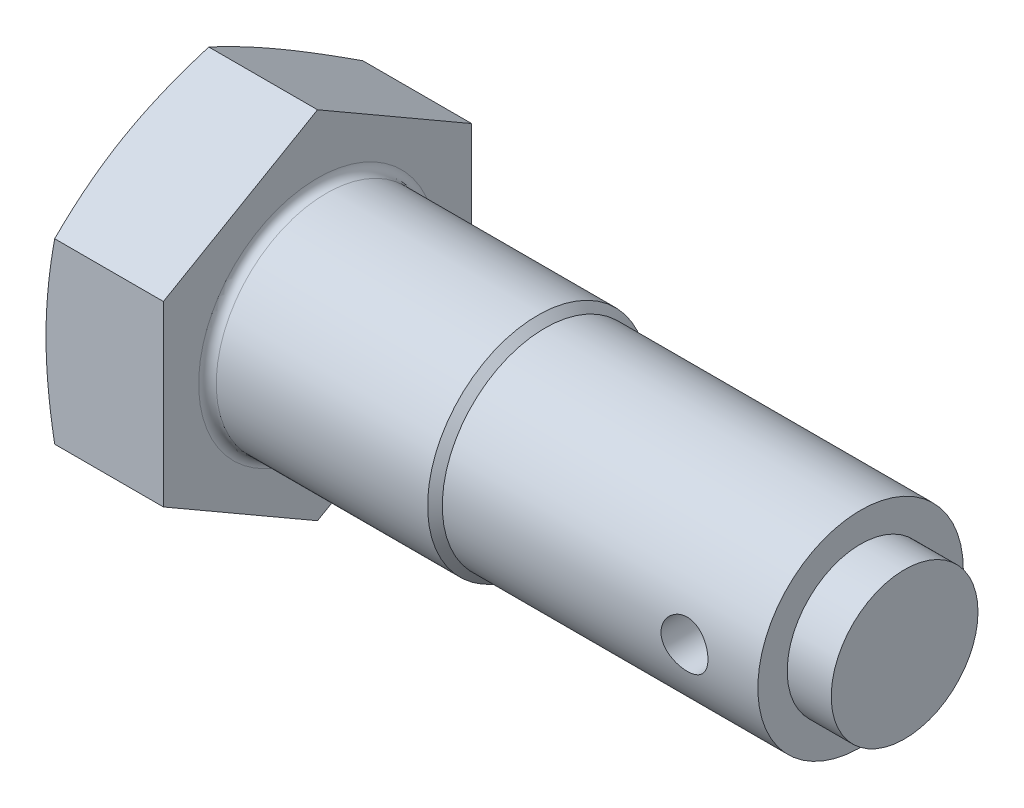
ISO-10303-21;
HEADER;
FILE_DESCRIPTION(('STEP AP214'),'2;1');
FILE_NAME('part.step','',(''),(''),'','','');
FILE_SCHEMA(('AUTOMOTIVE_DESIGN { 1 0 10303 214 1 1 1 1 }'));
ENDSEC;
DATA;
#1=APPLICATION_CONTEXT('core data for automotive mechanical design processes');
#2=APPLICATION_PROTOCOL_DEFINITION('international standard','automotive_design',2000,#1);
#3=PRODUCT_CONTEXT('',#1,'mechanical');
#4=PRODUCT('Part','Part','',(#3));
#5=PRODUCT_RELATED_PRODUCT_CATEGORY('part','',(#4));
#6=PRODUCT_DEFINITION_FORMATION('','',#4);
#7=PRODUCT_DEFINITION_CONTEXT('part definition',#1,'design');
#8=PRODUCT_DEFINITION('design','',#6,#7);
#9=PRODUCT_DEFINITION_SHAPE('','',#8);
#10=(LENGTH_UNIT() NAMED_UNIT(*) SI_UNIT(.MILLI.,.METRE.));
#11=(NAMED_UNIT(*) PLANE_ANGLE_UNIT() SI_UNIT($,.RADIAN.));
#12=(NAMED_UNIT(*) SI_UNIT($,.STERADIAN.) SOLID_ANGLE_UNIT());
#13=UNCERTAINTY_MEASURE_WITH_UNIT(LENGTH_MEASURE(1.E-05),#10,'distance_accuracy_value','');
#14=(GEOMETRIC_REPRESENTATION_CONTEXT(3) GLOBAL_UNCERTAINTY_ASSIGNED_CONTEXT((#13)) GLOBAL_UNIT_ASSIGNED_CONTEXT((#10,
#11,#12)) REPRESENTATION_CONTEXT('',''));
#15=CARTESIAN_POINT('',(0.,0.,0.));
#16=DIRECTION('',(0.,0.,1.));
#17=DIRECTION('',(1.,0.,0.));
#18=AXIS2_PLACEMENT_3D('',#15,#16,#17);
#19=CARTESIAN_POINT('',(8.,-6.06217782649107,10.5));
#20=DIRECTION('',(0.,0.866025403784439,-0.5));
#21=DIRECTION('',(0.,0.5,0.866025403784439));
#22=AXIS2_PLACEMENT_3D('',#19,#20,#21);
#23=PLANE('',#22);
#24=CARTESIAN_POINT('',(0.591259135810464,-12.124471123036,-0.000200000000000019));
#25=CARTESIAN_POINT('',(0.499848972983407,-11.8734134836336,0.434644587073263));
#26=CARTESIAN_POINT('',(0.416695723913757,-11.6215279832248,0.87092307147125));
#27=CARTESIAN_POINT('',(0.270400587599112,-11.1161192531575,1.74631667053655));
#28=CARTESIAN_POINT('',(0.207274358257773,-10.8625948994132,2.18543373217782));
#29=CARTESIAN_POINT('',(0.105169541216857,-10.3567219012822,3.06163146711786));
#30=CARTESIAN_POINT('',(0.0659682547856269,-10.1043848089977,3.49869213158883));
#31=CARTESIAN_POINT('',(0.0133883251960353,-9.59912055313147,4.37383549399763));
#32=CARTESIAN_POINT('',(0.,-9.34619364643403,4.81191774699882));
#33=CARTESIAN_POINT('',(0.,-8.84033983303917,5.68808225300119));
#34=CARTESIAN_POINT('',(0.0133883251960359,-8.58741292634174,6.12616450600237));
#35=CARTESIAN_POINT('',(0.0659682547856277,-8.0821486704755,7.00130786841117));
#36=CARTESIAN_POINT('',(0.105169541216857,-7.82981157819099,7.43836853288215));
#37=CARTESIAN_POINT('',(0.207274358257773,-7.32393858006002,8.31456626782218));
#38=CARTESIAN_POINT('',(0.270400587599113,-7.07041422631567,8.75368332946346));
#39=CARTESIAN_POINT('',(0.416695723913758,-6.56500549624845,9.62907692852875));
#40=CARTESIAN_POINT('',(0.499848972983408,-6.31311999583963,10.0653554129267));
#41=CARTESIAN_POINT('',(0.591259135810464,-6.06206235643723,10.5002));
#42=B_SPLINE_CURVE_WITH_KNOTS('',3,(#24,#25,#26,#27,#28,#29,#30,#31,#32,#33,#34,#35,#36,#37,#38,
#39,#40,#41),.UNSPECIFIED.,.F.,.F.,(4,2,2,2,2,2,2,2,4),(0.,1.5312621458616,3.06371855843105,
4.58168385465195,6.09907967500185,7.61647549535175,9.13444079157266,10.6668972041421,
12.1981593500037),.UNSPECIFIED.);
#43=CARTESIAN_POINT('',(0.591217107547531,-12.1243556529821,0.));
#44=VERTEX_POINT('',#43);
#45=CARTESIAN_POINT('',(0.,-9.09326673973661,5.25));
#46=VERTEX_POINT('',#45);
#47=EDGE_CURVE('E279',#44,#46,#42,.T.);
#48=ORIENTED_EDGE('',*,*,#47,.F.);
#49=DIRECTION('',(-1.,0.,0.));
#50=VECTOR('',#49,1.);
#51=CARTESIAN_POINT('',(8.,-12.1243556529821,0.));
#52=LINE('',#51,#50);
#53=CARTESIAN_POINT('',(8.,-12.1243556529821,0.));
#54=VERTEX_POINT('',#53);
#55=EDGE_CURVE('E149',#54,#44,#52,.T.);
#56=ORIENTED_EDGE('',*,*,#55,.F.);
#57=DIRECTION('',(0.,-0.5,-0.866025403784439));
#58=VECTOR('',#57,1.);
#59=CARTESIAN_POINT('',(8.,-6.06217782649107,10.5));
#60=LINE('',#59,#58);
#61=CARTESIAN_POINT('',(8.,-6.06217782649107,10.5));
#62=VERTEX_POINT('',#61);
#63=EDGE_CURVE('E291',#62,#54,#60,.T.);
#64=ORIENTED_EDGE('',*,*,#63,.F.);
#65=DIRECTION('',(-1.,0.,0.));
#66=VECTOR('',#65,1.);
#67=CARTESIAN_POINT('',(8.,-6.06217782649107,10.5));
#68=LINE('',#67,#66);
#69=CARTESIAN_POINT('',(0.591217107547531,-6.06217782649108,10.5));
#70=VERTEX_POINT('',#69);
#71=EDGE_CURVE('E136',#62,#70,#68,.T.);
#72=ORIENTED_EDGE('',*,*,#71,.T.);
#73=EDGE_CURVE('E130',#46,#70,#42,.T.);
#74=ORIENTED_EDGE('',*,*,#73,.F.);
#75=EDGE_LOOP('',(#48,#56,#64,#72,#74));
#76=FACE_BOUND('',#75,.T.);
#77=ADVANCED_FACE('F35',(#76),#23,.F.);
#78=CARTESIAN_POINT('',(8.,-12.1243556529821,0.));
#79=DIRECTION('',(0.,0.866025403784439,0.5));
#80=DIRECTION('',(0.,-0.5,0.866025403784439));
#81=AXIS2_PLACEMENT_3D('',#78,#79,#80);
#82=PLANE('',#81);
#83=CARTESIAN_POINT('',(0.591259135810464,-6.06206235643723,-10.5002));
#84=CARTESIAN_POINT('',(0.499848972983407,-6.31311999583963,-10.0653554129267));
#85=CARTESIAN_POINT('',(0.416695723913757,-6.56500549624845,-9.62907692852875));
#86=CARTESIAN_POINT('',(0.270400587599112,-7.07041422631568,-8.75368332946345));
#87=CARTESIAN_POINT('',(0.207274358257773,-7.32393858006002,-8.31456626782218));
#88=CARTESIAN_POINT('',(0.105169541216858,-7.82981157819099,-7.43836853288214));
#89=CARTESIAN_POINT('',(0.0659682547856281,-8.08214867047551,-7.00130786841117));
#90=CARTESIAN_POINT('',(0.0133883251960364,-8.58741292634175,-6.12616450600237));
#91=CARTESIAN_POINT('',(0.,-8.84033983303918,-5.68808225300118));
#92=CARTESIAN_POINT('',(0.,-9.34619364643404,-4.81191774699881));
#93=CARTESIAN_POINT('',(0.0133883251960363,-9.59912055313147,-4.37383549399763));
#94=CARTESIAN_POINT('',(0.0659682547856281,-10.1043848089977,-3.49869213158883));
#95=CARTESIAN_POINT('',(0.105169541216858,-10.3567219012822,-3.06163146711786));
#96=CARTESIAN_POINT('',(0.207274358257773,-10.8625948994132,-2.18543373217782));
#97=CARTESIAN_POINT('',(0.270400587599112,-11.1161192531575,-1.74631667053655));
#98=CARTESIAN_POINT('',(0.416695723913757,-11.6215279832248,-0.870923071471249));
#99=CARTESIAN_POINT('',(0.499848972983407,-11.8734134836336,-0.434644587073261));
#100=CARTESIAN_POINT('',(0.591259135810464,-12.124471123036,0.000200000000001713));
#101=B_SPLINE_CURVE_WITH_KNOTS('',3,(#83,#84,#85,#86,#87,#88,#89,#90,#91,#92,#93,#94,#95,#96,
#97,#98,#99,#100),.UNSPECIFIED.,.F.,.F.,(4,2,2,2,2,2,2,2,4),(0.,1.5312621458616,
3.06371855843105,4.58168385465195,6.09907967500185,7.61647549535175,9.13444079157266,
10.6668972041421,12.1981593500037),.UNSPECIFIED.);
#102=CARTESIAN_POINT('',(0.591217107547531,-6.06217782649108,-10.5));
#103=VERTEX_POINT('',#102);
#104=CARTESIAN_POINT('',(0.,-9.09326673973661,-5.25));
#105=VERTEX_POINT('',#104);
#106=EDGE_CURVE('E226',#103,#105,#101,.T.);
#107=ORIENTED_EDGE('',*,*,#106,.F.);
#108=DIRECTION('',(-1.,0.,0.));
#109=VECTOR('',#108,1.);
#110=CARTESIAN_POINT('',(8.,-6.06217782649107,-10.5));
#111=LINE('',#110,#109);
#112=CARTESIAN_POINT('',(8.,-6.06217782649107,-10.5));
#113=VERTEX_POINT('',#112);
#114=EDGE_CURVE('E146',#113,#103,#111,.T.);
#115=ORIENTED_EDGE('',*,*,#114,.F.);
#116=DIRECTION('',(0.,0.5,-0.866025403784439));
#117=VECTOR('',#116,1.);
#118=CARTESIAN_POINT('',(8.,-12.1243556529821,0.));
#119=LINE('',#118,#117);
#120=EDGE_CURVE('E286',#54,#113,#119,.T.);
#121=ORIENTED_EDGE('',*,*,#120,.F.);
#122=ORIENTED_EDGE('',*,*,#55,.T.);
#123=EDGE_CURVE('E222',#105,#44,#101,.T.);
#124=ORIENTED_EDGE('',*,*,#123,.F.);
#125=EDGE_LOOP('',(#107,#115,#121,#122,#124));
#126=FACE_BOUND('',#125,.T.);
#127=ADVANCED_FACE('F233',(#126),#82,.F.);
#128=CARTESIAN_POINT('',(8.,-6.06217782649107,-10.5));
#129=DIRECTION('',(0.,0.,1.));
#130=DIRECTION('',(1.,0.,0.));
#131=AXIS2_PLACEMENT_3D('',#128,#129,#130);
#132=PLANE('',#131);
#133=CARTESIAN_POINT('',(3.15922975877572,-16.0505152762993,-10.5));
#134=CARTESIAN_POINT('',(3.0145747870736,-15.5754573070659,-10.5));
#135=CARTESIAN_POINT('',(2.87160775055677,-15.0998758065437,-10.5));
#136=CARTESIAN_POINT('',(2.58998331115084,-14.1473992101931,-10.5));
#137=CARTESIAN_POINT('',(2.45132624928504,-13.6705040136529,-10.5));
#138=CARTESIAN_POINT('',(2.17902486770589,-12.7143172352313,-10.5));
#139=CARTESIAN_POINT('',(2.0453903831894,-12.2350228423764,-10.5));
#140=CARTESIAN_POINT('',(1.78469865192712,-11.2746511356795,-10.5));
#141=CARTESIAN_POINT('',(1.65764128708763,-10.7935738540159,-10.5));
#142=CARTESIAN_POINT('',(1.41324865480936,-9.83526050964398,-10.5));
#143=CARTESIAN_POINT('',(1.29581283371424,-9.35805021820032,-10.5));
#144=CARTESIAN_POINT('',(1.07093944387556,-8.40125497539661,-10.5));
#145=CARTESIAN_POINT('',(0.963502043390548,-7.92166998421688,-10.5));
#146=CARTESIAN_POINT('',(0.76113029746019,-6.96001802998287,-10.5));
#147=CARTESIAN_POINT('',(0.66619168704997,-6.47795197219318,-10.5));
#148=CARTESIAN_POINT('',(0.491708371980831,-5.51102112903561,-10.5));
#149=CARTESIAN_POINT('',(0.412163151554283,-5.0261564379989,-10.5));
#150=CARTESIAN_POINT('',(0.279574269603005,-4.10822599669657,-10.5));
#151=CARTESIAN_POINT('',(0.224559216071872,-3.67544767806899,-10.5));
#152=CARTESIAN_POINT('',(0.131431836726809,-2.80806103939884,-10.5));
#153=CARTESIAN_POINT('',(0.0933190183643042,-2.37345277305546,-10.5));
#154=CARTESIAN_POINT('',(0.0358315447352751,-1.50328778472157,-10.5));
#155=CARTESIAN_POINT('',(0.016443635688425,-1.06773195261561,-10.5));
#156=CARTESIAN_POINT('',(-0.00261241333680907,-0.196184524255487,-10.5));
#157=CARTESIAN_POINT('',(-0.00228069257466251,0.239807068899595,-10.5));
#158=CARTESIAN_POINT('',(0.0181361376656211,1.11353215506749,-10.5));
#159=CARTESIAN_POINT('',(0.0383214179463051,1.55126326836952,-10.5));
#160=CARTESIAN_POINT('',(0.0975164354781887,2.42543976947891,-10.5));
#161=CARTESIAN_POINT('',(0.136526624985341,2.86188512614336,-10.5));
#162=CARTESIAN_POINT('',(0.231546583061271,3.73327460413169,-10.5));
#163=CARTESIAN_POINT('',(0.287570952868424,4.16821711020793,-10.5));
#164=CARTESIAN_POINT('',(0.414346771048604,5.03592621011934,-10.5));
#165=CARTESIAN_POINT('',(0.485098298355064,5.46869279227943,-10.5));
#166=CARTESIAN_POINT('',(0.643097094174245,6.35482313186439,-10.5));
#167=CARTESIAN_POINT('',(0.731018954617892,6.80806553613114,-10.5));
#168=CARTESIAN_POINT('',(0.91817874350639,7.71222283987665,-10.5));
#169=CARTESIAN_POINT('',(1.01741752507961,8.16313756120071,-10.5));
#170=CARTESIAN_POINT('',(1.2251273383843,9.06296081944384,-10.5));
#171=CARTESIAN_POINT('',(1.3336010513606,9.51186873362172,-10.5));
#172=CARTESIAN_POINT('',(1.55801620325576,10.4077935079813,-10.5));
#173=CARTESIAN_POINT('',(1.67395746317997,10.8548104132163,-10.5));
#174=CARTESIAN_POINT('',(1.91206455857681,11.7477923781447,-10.5));
#175=CARTESIAN_POINT('',(2.03423819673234,12.1937553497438,-10.5));
#176=CARTESIAN_POINT('',(2.28355565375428,13.0842879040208,-10.5));
#177=CARTESIAN_POINT('',(2.41069949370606,13.5288574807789,-10.5));
#178=CARTESIAN_POINT('',(2.66904579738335,14.4167303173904,-10.5));
#179=CARTESIAN_POINT('',(2.80024755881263,14.8600337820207,-10.5));
#180=CARTESIAN_POINT('',(3.06603135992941,15.7456273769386,-10.5));
#181=CARTESIAN_POINT('',(3.20061342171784,16.1879175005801,-10.5));
#182=CARTESIAN_POINT('',(3.60555235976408,17.503732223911,-10.5));
#183=CARTESIAN_POINT('',(3.87998373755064,18.3760026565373,-10.5));
#184=CARTESIAN_POINT('',(4.43662333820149,20.1180920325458,-10.5));
#185=CARTESIAN_POINT('',(4.71883193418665,20.9879108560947,-10.5));
#186=CARTESIAN_POINT('',(5.28787047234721,22.7223782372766,-10.5));
#187=CARTESIAN_POINT('',(5.57467881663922,23.5870338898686,-10.5));
#188=CARTESIAN_POINT('',(6.00807288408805,24.882911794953,-10.5));
#189=CARTESIAN_POINT('',(6.15306192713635,25.314669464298,-10.5));
#190=CARTESIAN_POINT('',(6.44397819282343,26.1778674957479,-10.5));
#191=CARTESIAN_POINT('',(6.58990541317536,26.6093078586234,-10.5));
#192=CARTESIAN_POINT('',(6.73623905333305,27.0406104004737,-10.5));
#193=B_SPLINE_CURVE_WITH_KNOTS('',3,(#133,#134,#135,#136,#137,#138,#139,#140,#141,#142,#143,
#144,#145,#146,#147,#148,#149,#150,#151,#152,#153,#154,#155,#156,#157,#158,#159,#160,#161,#162,
#163,#164,#165,#166,#167,#168,#169,#170,#171,#172,#173,#174,#175,#176,#177,#178,#179,#180,#181,
#182,#183,#184,#185,#186,#187,#188,#189,#190,#191,#192),.UNSPECIFIED.,.F.,.F.,(4,2,2,2,2,2,2,2,
2,2,2,2,2,2,2,2,2,2,2,2,2,2,2,2,2,2,2,2,2,4),(0.,1.48979114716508,2.97969987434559,
4.47238840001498,5.96505011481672,7.43930808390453,8.91359085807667,10.3873692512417,
11.8610982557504,13.1695941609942,14.478051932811,15.7855828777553,17.093104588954,
18.4072573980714,19.72144178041,21.0367571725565,22.3520796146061,23.7369766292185,
25.1219781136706,26.5073830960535,27.8927548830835,29.2799058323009,30.6670626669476,
32.0539807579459,33.4409079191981,36.1841157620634,38.9274554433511,41.6603859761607,
43.0267411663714,44.3930930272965),.UNSPECIFIED.);
#194=CARTESIAN_POINT('',(0.591217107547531,6.06217782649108,-10.5));
#195=VERTEX_POINT('',#194);
#196=CARTESIAN_POINT('',(0.,0.,-10.5));
#197=VERTEX_POINT('',#196);
#198=EDGE_CURVE('E307',#195,#197,#193,.F.);
#199=ORIENTED_EDGE('',*,*,#198,.F.);
#200=DIRECTION('',(-1.,0.,0.));
#201=VECTOR('',#200,1.);
#202=CARTESIAN_POINT('',(8.,6.06217782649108,-10.5));
#203=LINE('',#202,#201);
#204=CARTESIAN_POINT('',(8.,6.06217782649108,-10.5));
#205=VERTEX_POINT('',#204);
#206=EDGE_CURVE('E138',#205,#195,#203,.T.);
#207=ORIENTED_EDGE('',*,*,#206,.F.);
#208=DIRECTION('',(0.,1.,0.));
#209=VECTOR('',#208,1.);
#210=CARTESIAN_POINT('',(8.,-6.06217782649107,-10.5));
#211=LINE('',#210,#209);
#212=EDGE_CURVE('E290',#113,#205,#211,.T.);
#213=ORIENTED_EDGE('',*,*,#212,.F.);
#214=ORIENTED_EDGE('',*,*,#114,.T.);
#215=EDGE_CURVE('E227',#197,#103,#193,.F.);
#216=ORIENTED_EDGE('',*,*,#215,.F.);
#217=EDGE_LOOP('',(#199,#207,#213,#214,#216));
#218=FACE_BOUND('',#217,.T.);
#219=ADVANCED_FACE('F236',(#218),#132,.F.);
#220=CARTESIAN_POINT('',(8.,6.06217782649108,-10.5));
#221=DIRECTION('',(0.,-0.866025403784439,0.5));
#222=DIRECTION('',(0.,-0.5,-0.866025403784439));
#223=AXIS2_PLACEMENT_3D('',#220,#221,#222);
#224=PLANE('',#223);
#225=CARTESIAN_POINT('',(0.591259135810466,12.124471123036,0.000199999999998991));
#226=CARTESIAN_POINT('',(0.49984897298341,11.8734134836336,-0.434644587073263));
#227=CARTESIAN_POINT('',(0.41669572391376,11.6215279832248,-0.870923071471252));
#228=CARTESIAN_POINT('',(0.270400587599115,11.1161192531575,-1.74631667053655));
#229=CARTESIAN_POINT('',(0.207274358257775,10.8625948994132,-2.18543373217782));
#230=CARTESIAN_POINT('',(0.10516954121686,10.3567219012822,-3.06163146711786));
#231=CARTESIAN_POINT('',(0.0659682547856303,10.1043848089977,-3.49869213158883));
#232=CARTESIAN_POINT('',(0.0133883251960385,9.59912055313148,-4.37383549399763));
#233=CARTESIAN_POINT('',(0.,9.34619364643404,-4.81191774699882));
#234=CARTESIAN_POINT('',(0.,8.84033983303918,-5.68808225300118));
#235=CARTESIAN_POINT('',(0.0133883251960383,8.58741292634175,-6.12616450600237));
#236=CARTESIAN_POINT('',(0.06596825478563,8.08214867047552,-7.00130786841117));
#237=CARTESIAN_POINT('',(0.10516954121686,7.829811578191,-7.43836853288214));
#238=CARTESIAN_POINT('',(0.207274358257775,7.32393858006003,-8.31456626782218));
#239=CARTESIAN_POINT('',(0.270400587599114,7.07041422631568,-8.75368332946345));
#240=CARTESIAN_POINT('',(0.416695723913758,6.56500549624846,-9.62907692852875));
#241=CARTESIAN_POINT('',(0.499848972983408,6.31311999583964,-10.0653554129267));
#242=CARTESIAN_POINT('',(0.591259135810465,6.06206235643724,-10.5002));
#243=B_SPLINE_CURVE_WITH_KNOTS('',3,(#225,#226,#227,#228,#229,#230,#231,#232,#233,#234,#235,
#236,#237,#238,#239,#240,#241,#242),.UNSPECIFIED.,.F.,.F.,(4,2,2,2,2,2,2,2,4),(0.,
1.5312621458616,3.06371855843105,4.58168385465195,6.09907967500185,7.61647549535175,
9.13444079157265,10.6668972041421,12.1981593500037),.UNSPECIFIED.);
#244=CARTESIAN_POINT('',(0.591217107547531,12.1243556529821,0.));
#245=VERTEX_POINT('',#244);
#246=CARTESIAN_POINT('',(0.,9.09326673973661,-5.25));
#247=VERTEX_POINT('',#246);
#248=EDGE_CURVE('E56',#245,#247,#243,.T.);
#249=ORIENTED_EDGE('',*,*,#248,.F.);
#250=DIRECTION('',(-1.,0.,0.));
#251=VECTOR('',#250,1.);
#252=CARTESIAN_POINT('',(8.,12.1243556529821,0.));
#253=LINE('',#252,#251);
#254=CARTESIAN_POINT('',(8.,12.1243556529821,0.));
#255=VERTEX_POINT('',#254);
#256=EDGE_CURVE('E135',#255,#245,#253,.T.);
#257=ORIENTED_EDGE('',*,*,#256,.F.);
#258=DIRECTION('',(0.,0.5,0.866025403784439));
#259=VECTOR('',#258,1.);
#260=CARTESIAN_POINT('',(8.,6.06217782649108,-10.5));
#261=LINE('',#260,#259);
#262=EDGE_CURVE('E299',#205,#255,#261,.T.);
#263=ORIENTED_EDGE('',*,*,#262,.F.);
#264=ORIENTED_EDGE('',*,*,#206,.T.);
#265=EDGE_CURVE('E305',#247,#195,#243,.T.);
#266=ORIENTED_EDGE('',*,*,#265,.F.);
#267=EDGE_LOOP('',(#249,#257,#263,#264,#266));
#268=FACE_BOUND('',#267,.T.);
#269=ADVANCED_FACE('F240',(#268),#224,.F.);
#270=CARTESIAN_POINT('',(8.,12.1243556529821,0.));
#271=DIRECTION('',(0.,-0.866025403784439,-0.5));
#272=DIRECTION('',(0.,0.5,-0.866025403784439));
#273=AXIS2_PLACEMENT_3D('',#270,#271,#272);
#274=PLANE('',#273);
#275=CARTESIAN_POINT('',(0.591259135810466,6.06206235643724,10.5002));
#276=CARTESIAN_POINT('',(0.49984897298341,6.31311999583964,10.0653554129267));
#277=CARTESIAN_POINT('',(0.41669572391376,6.56500549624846,9.62907692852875));
#278=CARTESIAN_POINT('',(0.270400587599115,7.07041422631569,8.75368332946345));
#279=CARTESIAN_POINT('',(0.207274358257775,7.32393858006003,8.31456626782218));
#280=CARTESIAN_POINT('',(0.10516954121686,7.829811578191,7.43836853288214));
#281=CARTESIAN_POINT('',(0.0659682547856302,8.08214867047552,7.00130786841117));
#282=CARTESIAN_POINT('',(0.013388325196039,8.58741292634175,6.12616450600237));
#283=CARTESIAN_POINT('',(0.,8.84033983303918,5.68808225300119));
#284=CARTESIAN_POINT('',(0.,9.34619364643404,4.81191774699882));
#285=CARTESIAN_POINT('',(0.013388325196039,9.59912055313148,4.37383549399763));
#286=CARTESIAN_POINT('',(0.0659682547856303,10.1043848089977,3.49869213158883));
#287=CARTESIAN_POINT('',(0.10516954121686,10.3567219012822,3.06163146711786));
#288=CARTESIAN_POINT('',(0.207274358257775,10.8625948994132,2.18543373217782));
#289=CARTESIAN_POINT('',(0.270400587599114,11.1161192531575,1.74631667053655));
#290=CARTESIAN_POINT('',(0.416695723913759,11.6215279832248,0.870923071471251));
#291=CARTESIAN_POINT('',(0.499848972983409,11.8734134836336,0.434644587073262));
#292=CARTESIAN_POINT('',(0.591259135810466,12.124471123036,-0.000199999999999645));
#293=B_SPLINE_CURVE_WITH_KNOTS('',3,(#275,#276,#277,#278,#279,#280,#281,#282,#283,#284,#285,
#286,#287,#288,#289,#290,#291,#292),.UNSPECIFIED.,.F.,.F.,(4,2,2,2,2,2,2,2,4),(0.,
1.5312621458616,3.06371855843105,4.58168385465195,6.09907967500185,7.61647549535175,
9.13444079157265,10.6668972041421,12.1981593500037),.UNSPECIFIED.);
#294=CARTESIAN_POINT('',(0.591217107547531,6.06217782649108,10.5));
#295=VERTEX_POINT('',#294);
#296=CARTESIAN_POINT('',(0.,9.09326673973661,5.25));
#297=VERTEX_POINT('',#296);
#298=EDGE_CURVE('E64',#295,#297,#293,.T.);
#299=ORIENTED_EDGE('',*,*,#298,.F.);
#300=DIRECTION('',(-1.,0.,0.));
#301=VECTOR('',#300,1.);
#302=CARTESIAN_POINT('',(8.,6.06217782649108,10.5));
#303=LINE('',#302,#301);
#304=CARTESIAN_POINT('',(8.,6.06217782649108,10.5));
#305=VERTEX_POINT('',#304);
#306=EDGE_CURVE('E126',#305,#295,#303,.T.);
#307=ORIENTED_EDGE('',*,*,#306,.F.);
#308=DIRECTION('',(0.,-0.5,0.866025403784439));
#309=VECTOR('',#308,1.);
#310=CARTESIAN_POINT('',(8.,12.1243556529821,0.));
#311=LINE('',#310,#309);
#312=EDGE_CURVE('E301',#255,#305,#311,.T.);
#313=ORIENTED_EDGE('',*,*,#312,.F.);
#314=ORIENTED_EDGE('',*,*,#256,.T.);
#315=EDGE_CURVE('E129',#297,#245,#293,.T.);
#316=ORIENTED_EDGE('',*,*,#315,.F.);
#317=EDGE_LOOP('',(#299,#307,#313,#314,#316));
#318=FACE_BOUND('',#317,.T.);
#319=ADVANCED_FACE('F124',(#318),#274,.F.);
#320=CARTESIAN_POINT('',(8.,6.06217782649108,10.5));
#321=DIRECTION('',(0.,0.,-1.));
#322=DIRECTION('',(0.,1.,0.));
#323=AXIS2_PLACEMENT_3D('',#320,#321,#322);
#324=PLANE('',#323);
#325=CARTESIAN_POINT('',(3.15923032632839,-16.0505171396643,10.5));
#326=CARTESIAN_POINT('',(3.01457532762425,-15.5754590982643,10.5));
#327=CARTESIAN_POINT('',(2.87160826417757,-15.0998775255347,10.5));
#328=CARTESIAN_POINT('',(2.58998377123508,-14.1474007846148,10.5));
#329=CARTESIAN_POINT('',(2.45132668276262,-13.6705055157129,10.5));
#330=CARTESIAN_POINT('',(2.17902524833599,-12.7143185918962,10.5));
#331=CARTESIAN_POINT('',(2.04539073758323,-12.2350241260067,10.5));
#332=CARTESIAN_POINT('',(1.78469895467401,-11.2746522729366,10.5));
#333=CARTESIAN_POINT('',(1.65764156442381,-10.7935749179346,10.5));
#334=CARTESIAN_POINT('',(1.41324888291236,-9.83526142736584,10.5));
#335=CARTESIAN_POINT('',(1.29581303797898,-9.35805106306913,10.5));
#336=CARTESIAN_POINT('',(1.07093960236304,-8.40125567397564,10.5));
#337=CARTESIAN_POINT('',(0.96350217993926,-7.92167060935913,10.5));
#338=CARTESIAN_POINT('',(0.761130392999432,-6.96001850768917,10.5));
#339=CARTESIAN_POINT('',(0.666191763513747,-6.47795237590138,10.5));
#340=CARTESIAN_POINT('',(0.491708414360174,-5.51102138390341,10.5));
#341=CARTESIAN_POINT('',(0.412163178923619,-5.02615661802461,10.5));
#342=CARTESIAN_POINT('',(0.279574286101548,-4.10822611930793,10.5));
#343=CARTESIAN_POINT('',(0.224559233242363,-3.67544781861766,10.5));
#344=CARTESIAN_POINT('',(0.131431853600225,-2.80806121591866,10.5));
#345=CARTESIAN_POINT('',(0.0933190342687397,-2.37345296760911,10.5));
#346=CARTESIAN_POINT('',(0.0358315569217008,-1.50328801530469,10.5));
#347=CARTESIAN_POINT('',(0.0164436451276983,-1.06773220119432,10.5));
#348=CARTESIAN_POINT('',(-0.00261241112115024,-0.19618480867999,10.5));
#349=CARTESIAN_POINT('',(-0.00228069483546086,0.239806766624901,10.5));
#350=CARTESIAN_POINT('',(0.0181361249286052,1.11353181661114,10.5));
#351=CARTESIAN_POINT('',(0.0383213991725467,1.5512629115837,10.5));
#352=CARTESIAN_POINT('',(0.0975164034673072,2.42543937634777,10.5));
#353=CARTESIAN_POINT('',(0.136526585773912,2.86188471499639,10.5));
#354=CARTESIAN_POINT('',(0.231546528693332,3.73327415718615,10.5));
#355=CARTESIAN_POINT('',(0.287570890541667,4.16821664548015,10.5));
#356=CARTESIAN_POINT('',(0.414346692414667,5.03592571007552,10.5));
#357=CARTESIAN_POINT('',(0.485098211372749,5.46869227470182,10.5));
#358=CARTESIAN_POINT('',(0.643096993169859,6.35482259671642,10.5));
#359=CARTESIAN_POINT('',(0.731018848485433,6.80806500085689,10.5));
#360=CARTESIAN_POINT('',(0.91817862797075,7.71222230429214,10.5));
#361=CARTESIAN_POINT('',(1.01741740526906,8.16313702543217,10.5));
#362=CARTESIAN_POINT('',(1.22512721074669,9.0629602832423,10.5));
#363=CARTESIAN_POINT('',(1.33360092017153,9.51186819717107,10.5));
#364=CARTESIAN_POINT('',(1.55801606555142,10.4077929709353,10.5));
#365=CARTESIAN_POINT('',(1.67395732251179,10.8548098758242,10.5));
#366=CARTESIAN_POINT('',(1.91206441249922,11.7477918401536,10.5));
#367=CARTESIAN_POINT('',(2.03423804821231,12.1937548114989,10.5));
#368=CARTESIAN_POINT('',(2.28355550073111,13.0842873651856,10.5));
#369=CARTESIAN_POINT('',(2.4106993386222,13.528856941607,10.5));
#370=CARTESIAN_POINT('',(2.66904563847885,14.4167297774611,10.5));
#371=CARTESIAN_POINT('',(2.80024739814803,14.8600332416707,10.5));
#372=CARTESIAN_POINT('',(3.06603119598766,15.745626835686,10.5));
#373=CARTESIAN_POINT('',(3.20061325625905,16.1879169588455,10.5));
#374=CARTESIAN_POINT('',(3.60555219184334,17.503731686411,10.5));
#375=CARTESIAN_POINT('',(3.8799835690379,18.3760021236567,10.5));
#376=CARTESIAN_POINT('',(4.43662316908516,20.1180915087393,10.5));
#377=CARTESIAN_POINT('',(4.71883176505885,20.9879103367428,10.5));
#378=CARTESIAN_POINT('',(5.28787030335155,22.7223777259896,10.5));
#379=CARTESIAN_POINT('',(5.57467864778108,23.5870333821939,10.5));
#380=CARTESIAN_POINT('',(6.00807271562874,24.8829112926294,10.5));
#381=CARTESIAN_POINT('',(6.15306175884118,25.3146689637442,10.5));
#382=CARTESIAN_POINT('',(6.44397802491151,26.1778669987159,10.5));
#383=CARTESIAN_POINT('',(6.58990524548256,26.6093073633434,10.5));
#384=CARTESIAN_POINT('',(6.73623888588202,27.0406099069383,10.5));
#385=B_SPLINE_CURVE_WITH_KNOTS('',3,(#325,#326,#327,#328,#329,#330,#331,#332,#333,#334,#335,
#336,#337,#338,#339,#340,#341,#342,#343,#344,#345,#346,#347,#348,#349,#350,#351,#352,#353,#354,
#355,#356,#357,#358,#359,#360,#361,#362,#363,#364,#365,#366,#367,#368,#369,#370,#371,#372,#373,
#374,#375,#376,#377,#378,#379,#380,#381,#382,#383,#384),.UNSPECIFIED.,.F.,.F.,(4,2,2,2,2,2,2,2,
2,2,2,2,2,2,2,2,2,2,2,2,2,2,2,2,2,2,2,2,2,4),(0.,1.48979137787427,2.97970033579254,
4.47238909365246,5.96505104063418,7.43930923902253,8.9135922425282,10.3873708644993,
11.8611000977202,13.1695959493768,14.4780536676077,15.7855845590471,17.0931062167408,
18.4072589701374,19.721443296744,21.0367586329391,22.3520810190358,23.7369780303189,
25.121979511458,26.5073844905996,27.892756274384,29.2799072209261,30.6670640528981,
32.0539821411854,33.4409092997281,36.1841171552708,38.9274568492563,41.6603873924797,
43.0267425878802,44.3930944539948),.UNSPECIFIED.);
#386=CARTESIAN_POINT('',(0.,0.,10.5));
#387=VERTEX_POINT('',#386);
#388=EDGE_CURVE('E119',#70,#387,#385,.T.);
#389=ORIENTED_EDGE('',*,*,#388,.F.);
#390=ORIENTED_EDGE('',*,*,#71,.F.);
#391=DIRECTION('',(0.,-1.,0.));
#392=VECTOR('',#391,1.);
#393=CARTESIAN_POINT('',(8.,6.06217782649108,10.5));
#394=LINE('',#393,#392);
#395=EDGE_CURVE('E134',#305,#62,#394,.T.);
#396=ORIENTED_EDGE('',*,*,#395,.F.);
#397=ORIENTED_EDGE('',*,*,#306,.T.);
#398=EDGE_CURVE('E111',#387,#295,#385,.T.);
#399=ORIENTED_EDGE('',*,*,#398,.F.);
#400=EDGE_LOOP('',(#389,#390,#396,#397,#399));
#401=FACE_BOUND('',#400,.T.);
#402=ADVANCED_FACE('F132',(#401),#324,.F.);
#403=CARTESIAN_POINT('',(107.798989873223,0.,0.));
#404=DIRECTION('',(-1.,0.,0.));
#405=DIRECTION('',(0.,0.,1.));
#406=AXIS2_PLACEMENT_3D('',#403,#404,#405);
#407=CYLINDRICAL_SURFACE('',#406,7.);
#408=CARTESIAN_POINT('',(41.6,0.,7.));
#409=CARTESIAN_POINT('',(41.599997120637,-0.088637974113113,6.9999983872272));
#410=CARTESIAN_POINT('',(41.5926095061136,-0.177309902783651,6.9982994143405));
#411=CARTESIAN_POINT('',(41.5632889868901,-0.352128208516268,6.99168612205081));
#412=CARTESIAN_POINT('',(41.541346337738,-0.438272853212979,6.98676964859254));
#413=CARTESIAN_POINT('',(41.483644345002,-0.605485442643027,6.97426787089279));
#414=CARTESIAN_POINT('',(41.4479000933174,-0.686558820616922,6.96668548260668));
#415=CARTESIAN_POINT('',(41.3636590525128,-0.841556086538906,6.94966694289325));
#416=CARTESIAN_POINT('',(41.315162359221,-0.915480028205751,6.94023080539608));
#417=CARTESIAN_POINT('',(41.2058991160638,-1.05537027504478,6.92035181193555));
#418=CARTESIAN_POINT('',(41.1449526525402,-1.12119415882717,6.90989552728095));
#419=CARTESIAN_POINT('',(41.0129058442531,-1.24177996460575,6.88924768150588));
#420=CARTESIAN_POINT('',(40.941804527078,-1.29654082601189,6.87905614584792));
#421=CARTESIAN_POINT('',(40.7903973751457,-1.39408692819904,6.85995847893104));
#422=CARTESIAN_POINT('',(40.709990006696,-1.43671823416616,6.8510695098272));
#423=CARTESIAN_POINT('',(40.542915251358,-1.5078069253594,6.83577715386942));
#424=CARTESIAN_POINT('',(40.4562486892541,-1.53626617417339,6.82937344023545));
#425=CARTESIAN_POINT('',(40.2806672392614,-1.57772761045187,6.81991381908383));
#426=CARTESIAN_POINT('',(40.1918152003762,-1.59098317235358,6.81680310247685));
#427=CARTESIAN_POINT('',(40.0130981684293,-1.60244923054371,6.81411724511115));
#428=CARTESIAN_POINT('',(39.9232333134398,-1.60066175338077,6.81454162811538));
#429=CARTESIAN_POINT('',(39.7469424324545,-1.58229584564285,6.81882850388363));
#430=CARTESIAN_POINT('',(39.6604835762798,-1.56601399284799,6.82262205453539));
#431=CARTESIAN_POINT('',(39.4915580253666,-1.51959235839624,6.83311056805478));
#432=CARTESIAN_POINT('',(39.4090915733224,-1.48945173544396,6.83980570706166));
#433=CARTESIAN_POINT('',(39.2496696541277,-1.41590179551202,6.85540954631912));
#434=CARTESIAN_POINT('',(39.1727677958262,-1.37238038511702,6.86433682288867));
#435=CARTESIAN_POINT('',(39.0272498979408,-1.27338296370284,6.88338794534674));
#436=CARTESIAN_POINT('',(38.9586350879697,-1.2179051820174,6.89351196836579));
#437=CARTESIAN_POINT('',(38.8299338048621,-1.09501002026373,6.91411002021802));
#438=CARTESIAN_POINT('',(38.7700877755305,-1.02734100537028,6.9245866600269));
#439=CARTESIAN_POINT('',(38.6625521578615,-0.88280618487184,6.94449181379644));
#440=CARTESIAN_POINT('',(38.6148628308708,-0.805940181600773,6.95392030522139));
#441=CARTESIAN_POINT('',(38.5329263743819,-0.644884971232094,6.97070200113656));
#442=CARTESIAN_POINT('',(38.4987130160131,-0.56067800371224,6.9780499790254));
#443=CARTESIAN_POINT('',(38.4449901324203,-0.387504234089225,6.98980420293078));
#444=CARTESIAN_POINT('',(38.4254782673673,-0.29853819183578,6.99421091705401));
#445=CARTESIAN_POINT('',(38.4020672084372,-0.120432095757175,6.99951866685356));
#446=CARTESIAN_POINT('',(38.3978398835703,-0.0313373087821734,7.00049336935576));
#447=CARTESIAN_POINT('',(38.4042253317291,0.146285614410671,6.99903472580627));
#448=CARTESIAN_POINT('',(38.4148370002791,0.23481379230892,6.9966016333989));
#449=CARTESIAN_POINT('',(38.4503275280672,0.407687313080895,6.98864749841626));
#450=CARTESIAN_POINT('',(38.475032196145,0.492070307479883,6.98316417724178));
#451=CARTESIAN_POINT('',(38.5378124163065,0.6554934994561,6.96972431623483));
#452=CARTESIAN_POINT('',(38.5758891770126,0.73453321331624,6.96176755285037));
#453=CARTESIAN_POINT('',(38.6650018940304,0.886367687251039,6.94408308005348));
#454=CARTESIAN_POINT('',(38.7162279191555,0.959047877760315,6.93433004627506));
#455=CARTESIAN_POINT('',(38.8299370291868,1.09489796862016,6.91418274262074));
#456=CARTESIAN_POINT('',(38.8924217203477,1.15806650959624,6.90378838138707));
#457=CARTESIAN_POINT('',(39.028386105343,1.27441433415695,6.88327217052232));
#458=CARTESIAN_POINT('',(39.1020628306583,1.32736542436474,6.87316010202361));
#459=CARTESIAN_POINT('',(39.2574547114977,1.4201456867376,6.85459217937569));
#460=CARTESIAN_POINT('',(39.3391695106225,1.45997544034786,6.84613625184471));
#461=CARTESIAN_POINT('',(39.5078729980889,1.52510233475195,6.83192320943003));
#462=CARTESIAN_POINT('',(39.5948278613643,1.55048352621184,6.8261505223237));
#463=CARTESIAN_POINT('',(39.771918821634,1.58623294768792,6.81793280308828));
#464=CARTESIAN_POINT('',(39.8620543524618,1.59660383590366,6.81548718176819));
#465=CARTESIAN_POINT('',(40.0406412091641,1.60191713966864,6.81424002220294));
#466=CARTESIAN_POINT('',(40.1290813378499,1.59722216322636,6.81535283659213));
#467=CARTESIAN_POINT('',(40.3038739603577,1.57335344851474,6.82090215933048));
#468=CARTESIAN_POINT('',(40.3902264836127,1.55417991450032,6.8253386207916));
#469=CARTESIAN_POINT('',(40.5580726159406,1.50208069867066,6.83699174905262));
#470=CARTESIAN_POINT('',(40.6395848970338,1.46921240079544,6.84419680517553));
#471=CARTESIAN_POINT('',(40.7959903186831,1.39070434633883,6.86057886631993));
#472=CARTESIAN_POINT('',(40.8708826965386,1.34506312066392,6.86975609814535));
#473=CARTESIAN_POINT('',(41.0136994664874,1.24112205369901,6.88930081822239));
#474=CARTESIAN_POINT('',(41.0814343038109,1.18256580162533,6.89969005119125));
#475=CARTESIAN_POINT('',(41.2062349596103,1.05497064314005,6.92034723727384));
#476=CARTESIAN_POINT('',(41.263298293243,0.985929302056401,6.93061516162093));
#477=CARTESIAN_POINT('',(41.3659307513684,0.838120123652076,6.95004925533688));
#478=CARTESIAN_POINT('',(41.4113217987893,0.759226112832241,6.95919735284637));
#479=CARTESIAN_POINT('',(41.4881258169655,0.594732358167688,6.97517728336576));
#480=CARTESIAN_POINT('',(41.519550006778,0.509138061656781,6.98201097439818));
#481=CARTESIAN_POINT('',(41.5622055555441,0.352937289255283,6.99143480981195));
#482=CARTESIAN_POINT('',(41.5763503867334,0.283148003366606,6.9946262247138));
#483=CARTESIAN_POINT('',(41.5952485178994,0.142246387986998,6.99890941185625));
#484=CARTESIAN_POINT('',(41.6000023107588,0.0711341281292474,7.00000129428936));
#485=CARTESIAN_POINT('',(41.6,0.,7.));
#486=B_SPLINE_CURVE_WITH_KNOTS('',3,(#408,#409,#410,#411,#412,#413,#414,#415,#416,#417,#418,
#419,#420,#421,#422,#423,#424,#425,#426,#427,#428,#429,#430,#431,#432,#433,#434,#435,#436,#437,
#438,#439,#440,#441,#442,#443,#444,#445,#446,#447,#448,#449,#450,#451,#452,#453,#454,#455,#456,
#457,#458,#459,#460,#461,#462,#463,#464,#465,#466,#467,#468,#469,#470,#471,#472,#473,#474,#475,
#476,#477,#478,#479,#480,#481,#482,#483,#484,#485),.UNSPECIFIED.,.T.,.F.,(4,2,2,2,2,2,2,2,2,2,2,
2,2,2,2,2,2,2,2,2,2,2,2,2,2,2,2,2,2,2,2,2,2,2,2,2,2,2,4),(0.,0.265653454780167,0.53148494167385,
0.797026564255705,1.06256619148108,1.33225579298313,1.60197123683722,1.87497075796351,
2.14793437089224,2.41627965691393,2.68458879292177,2.94753095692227,3.21048908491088,
3.47571302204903,3.74097626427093,4.01252133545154,4.28407224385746,4.55629940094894,
4.82848322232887,5.094787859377,5.36107267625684,5.62413536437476,5.88722183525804,
6.15434929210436,6.42151488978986,6.69409075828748,6.96665454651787,7.23761612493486,
7.50852971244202,7.77297224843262,8.03741105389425,8.30075277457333,8.56412479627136,
8.83329128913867,9.10252037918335,9.37564127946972,9.64854239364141,9.86174693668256,
10.0749402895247),.UNSPECIFIED.);
#487=CARTESIAN_POINT('',(41.6,0.,7.));
#488=VERTEX_POINT('',#487);
#489=EDGE_CURVE('E39',#488,#488,#486,.T.);
#490=ORIENTED_EDGE('',*,*,#489,.T.);
#491=EDGE_LOOP('',(#490));
#492=FACE_BOUND('',#491,.T.);
#493=CARTESIAN_POINT('',(41.6,0.,-7.));
#494=CARTESIAN_POINT('',(41.599997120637,0.088637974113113,-6.9999983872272));
#495=CARTESIAN_POINT('',(41.5926095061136,0.177309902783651,-6.9982994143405));
#496=CARTESIAN_POINT('',(41.5632889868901,0.352128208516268,-6.99168612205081));
#497=CARTESIAN_POINT('',(41.541346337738,0.438272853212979,-6.98676964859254));
#498=CARTESIAN_POINT('',(41.483644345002,0.605485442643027,-6.97426787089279));
#499=CARTESIAN_POINT('',(41.4479000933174,0.686558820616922,-6.96668548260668));
#500=CARTESIAN_POINT('',(41.3636590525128,0.841556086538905,-6.94966694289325));
#501=CARTESIAN_POINT('',(41.315162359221,0.915480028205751,-6.94023080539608));
#502=CARTESIAN_POINT('',(41.2058991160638,1.05537027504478,-6.92035181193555));
#503=CARTESIAN_POINT('',(41.1449526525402,1.12119415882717,-6.90989552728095));
#504=CARTESIAN_POINT('',(41.0129058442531,1.24177996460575,-6.88924768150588));
#505=CARTESIAN_POINT('',(40.941804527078,1.29654082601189,-6.87905614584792));
#506=CARTESIAN_POINT('',(40.7903973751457,1.39408692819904,-6.85995847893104));
#507=CARTESIAN_POINT('',(40.709990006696,1.43671823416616,-6.8510695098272));
#508=CARTESIAN_POINT('',(40.542915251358,1.5078069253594,-6.83577715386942));
#509=CARTESIAN_POINT('',(40.4562486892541,1.53626617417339,-6.82937344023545));
#510=CARTESIAN_POINT('',(40.2806672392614,1.57772761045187,-6.81991381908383));
#511=CARTESIAN_POINT('',(40.1918152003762,1.59098317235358,-6.81680310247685));
#512=CARTESIAN_POINT('',(40.0130981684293,1.60244923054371,-6.81411724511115));
#513=CARTESIAN_POINT('',(39.9232333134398,1.60066175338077,-6.81454162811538));
#514=CARTESIAN_POINT('',(39.7469424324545,1.58229584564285,-6.81882850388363));
#515=CARTESIAN_POINT('',(39.6604835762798,1.56601399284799,-6.82262205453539));
#516=CARTESIAN_POINT('',(39.4915580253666,1.51959235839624,-6.83311056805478));
#517=CARTESIAN_POINT('',(39.4090915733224,1.48945173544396,-6.83980570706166));
#518=CARTESIAN_POINT('',(39.2496696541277,1.41590179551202,-6.85540954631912));
#519=CARTESIAN_POINT('',(39.1727677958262,1.37238038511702,-6.86433682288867));
#520=CARTESIAN_POINT('',(39.0272498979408,1.27338296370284,-6.88338794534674));
#521=CARTESIAN_POINT('',(38.9586350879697,1.2179051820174,-6.89351196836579));
#522=CARTESIAN_POINT('',(38.8299338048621,1.09501002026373,-6.91411002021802));
#523=CARTESIAN_POINT('',(38.7700877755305,1.02734100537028,-6.9245866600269));
#524=CARTESIAN_POINT('',(38.6625521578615,0.88280618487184,-6.94449181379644));
#525=CARTESIAN_POINT('',(38.6148628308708,0.805940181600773,-6.95392030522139));
#526=CARTESIAN_POINT('',(38.5329263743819,0.644884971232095,-6.97070200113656));
#527=CARTESIAN_POINT('',(38.4987130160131,0.56067800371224,-6.9780499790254));
#528=CARTESIAN_POINT('',(38.4449901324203,0.387504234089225,-6.98980420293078));
#529=CARTESIAN_POINT('',(38.4254782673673,0.29853819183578,-6.99421091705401));
#530=CARTESIAN_POINT('',(38.4020672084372,0.120432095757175,-6.99951866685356));
#531=CARTESIAN_POINT('',(38.3978398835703,0.0313373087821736,-7.00049336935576));
#532=CARTESIAN_POINT('',(38.4042253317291,-0.146285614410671,-6.99903472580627));
#533=CARTESIAN_POINT('',(38.4148370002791,-0.23481379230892,-6.9966016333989));
#534=CARTESIAN_POINT('',(38.4503275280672,-0.407687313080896,-6.98864749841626));
#535=CARTESIAN_POINT('',(38.475032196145,-0.492070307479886,-6.98316417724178));
#536=CARTESIAN_POINT('',(38.5378124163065,-0.655493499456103,-6.96972431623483));
#537=CARTESIAN_POINT('',(38.5758891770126,-0.734533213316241,-6.96176755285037));
#538=CARTESIAN_POINT('',(38.6650018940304,-0.886367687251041,-6.94408308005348));
#539=CARTESIAN_POINT('',(38.7162279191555,-0.959047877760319,-6.93433004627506));
#540=CARTESIAN_POINT('',(38.8299370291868,-1.09489796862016,-6.91418274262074));
#541=CARTESIAN_POINT('',(38.8924217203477,-1.15806650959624,-6.90378838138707));
#542=CARTESIAN_POINT('',(39.028386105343,-1.27441433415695,-6.88327217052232));
#543=CARTESIAN_POINT('',(39.1020628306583,-1.32736542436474,-6.87316010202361));
#544=CARTESIAN_POINT('',(39.2574547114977,-1.4201456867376,-6.85459217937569));
#545=CARTESIAN_POINT('',(39.3391695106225,-1.45997544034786,-6.84613625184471));
#546=CARTESIAN_POINT('',(39.5078729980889,-1.52510233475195,-6.83192320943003));
#547=CARTESIAN_POINT('',(39.5948278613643,-1.55048352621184,-6.8261505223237));
#548=CARTESIAN_POINT('',(39.771918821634,-1.58623294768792,-6.81793280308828));
#549=CARTESIAN_POINT('',(39.8620543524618,-1.59660383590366,-6.81548718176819));
#550=CARTESIAN_POINT('',(40.0406412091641,-1.60191713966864,-6.81424002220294));
#551=CARTESIAN_POINT('',(40.1290813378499,-1.59722216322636,-6.81535283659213));
#552=CARTESIAN_POINT('',(40.3038739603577,-1.57335344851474,-6.82090215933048));
#553=CARTESIAN_POINT('',(40.3902264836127,-1.55417991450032,-6.8253386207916));
#554=CARTESIAN_POINT('',(40.5580726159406,-1.50208069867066,-6.83699174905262));
#555=CARTESIAN_POINT('',(40.6395848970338,-1.46921240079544,-6.84419680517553));
#556=CARTESIAN_POINT('',(40.7959903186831,-1.39070434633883,-6.86057886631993));
#557=CARTESIAN_POINT('',(40.8708826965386,-1.34506312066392,-6.86975609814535));
#558=CARTESIAN_POINT('',(41.0136994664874,-1.24112205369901,-6.88930081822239));
#559=CARTESIAN_POINT('',(41.0814343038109,-1.18256580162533,-6.89969005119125));
#560=CARTESIAN_POINT('',(41.2062349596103,-1.05497064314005,-6.92034723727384));
#561=CARTESIAN_POINT('',(41.263298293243,-0.985929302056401,-6.93061516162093));
#562=CARTESIAN_POINT('',(41.3659307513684,-0.838120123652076,-6.95004925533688));
#563=CARTESIAN_POINT('',(41.4113217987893,-0.759226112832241,-6.95919735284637));
#564=CARTESIAN_POINT('',(41.4881258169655,-0.594732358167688,-6.97517728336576));
#565=CARTESIAN_POINT('',(41.519550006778,-0.509138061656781,-6.98201097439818));
#566=CARTESIAN_POINT('',(41.5622055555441,-0.352937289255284,-6.99143480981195));
#567=CARTESIAN_POINT('',(41.5763503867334,-0.283148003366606,-6.9946262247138));
#568=CARTESIAN_POINT('',(41.5952485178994,-0.142246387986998,-6.99890941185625));
#569=CARTESIAN_POINT('',(41.6000023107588,-0.0711341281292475,-7.00000129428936));
#570=CARTESIAN_POINT('',(41.6,0.,-7.));
#571=B_SPLINE_CURVE_WITH_KNOTS('',3,(#493,#494,#495,#496,#497,#498,#499,#500,#501,#502,#503,
#504,#505,#506,#507,#508,#509,#510,#511,#512,#513,#514,#515,#516,#517,#518,#519,#520,#521,#522,
#523,#524,#525,#526,#527,#528,#529,#530,#531,#532,#533,#534,#535,#536,#537,#538,#539,#540,#541,
#542,#543,#544,#545,#546,#547,#548,#549,#550,#551,#552,#553,#554,#555,#556,#557,#558,#559,#560,
#561,#562,#563,#564,#565,#566,#567,#568,#569,#570),.UNSPECIFIED.,.T.,.F.,(4,2,2,2,2,2,2,2,2,2,2,
2,2,2,2,2,2,2,2,2,2,2,2,2,2,2,2,2,2,2,2,2,2,2,2,2,2,2,4),(0.,0.265653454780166,
0.531484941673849,0.797026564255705,1.06256619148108,1.33225579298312,1.60197123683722,
1.87497075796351,2.14793437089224,2.41627965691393,2.68458879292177,2.94753095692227,
3.21048908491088,3.47571302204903,3.74097626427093,4.01252133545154,4.28407224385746,
4.55629940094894,4.82848322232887,5.094787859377,5.36107267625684,5.62413536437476,
5.88722183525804,6.15434929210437,6.42151488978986,6.69409075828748,6.96665454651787,
7.23761612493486,7.50852971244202,7.77297224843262,8.03741105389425,8.30075277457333,
8.56412479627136,8.83329128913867,9.10252037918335,9.37564127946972,9.64854239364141,
9.86174693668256,10.0749402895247),.UNSPECIFIED.);
#572=CARTESIAN_POINT('',(41.6,0.,-7.));
#573=VERTEX_POINT('',#572);
#574=EDGE_CURVE('E166',#573,#573,#571,.T.);
#575=ORIENTED_EDGE('',*,*,#574,.T.);
#576=EDGE_LOOP('',(#575));
#577=FACE_BOUND('',#576,.T.);
#578=CARTESIAN_POINT('',(23.5,0.,0.));
#579=DIRECTION('',(1.,0.,0.));
#580=DIRECTION('',(0.,0.,-1.));
#581=AXIS2_PLACEMENT_3D('',#578,#579,#580);
#582=CIRCLE('',#581,7.);
#583=CARTESIAN_POINT('',(23.5,0.,-7.));
#584=VERTEX_POINT('',#583);
#585=EDGE_CURVE('E13',#584,#584,#582,.T.);
#586=ORIENTED_EDGE('',*,*,#585,.T.);
#587=EDGE_LOOP('',(#586));
#588=FACE_BOUND('',#587,.T.);
#589=CARTESIAN_POINT('',(45.,0.,0.));
#590=DIRECTION('',(1.,0.,0.));
#591=DIRECTION('',(0.,0.,-1.));
#592=AXIS2_PLACEMENT_3D('',#589,#590,#591);
#593=CIRCLE('',#592,7.);
#594=CARTESIAN_POINT('',(45.,0.,-7.));
#595=VERTEX_POINT('',#594);
#596=EDGE_CURVE('E153',#595,#595,#593,.T.);
#597=ORIENTED_EDGE('',*,*,#596,.F.);
#598=EDGE_LOOP('',(#597));
#599=FACE_BOUND('',#598,.T.);
#600=ADVANCED_FACE('F170',(#492,#577,#588,#599),#407,.T.);
#601=CARTESIAN_POINT('',(8.,-12.1243556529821,0.));
#602=DIRECTION('',(1.,0.,0.));
#603=DIRECTION('',(0.,0.,-1.));
#604=AXIS2_PLACEMENT_3D('',#601,#602,#603);
#605=PLANE('',#604);
#606=CARTESIAN_POINT('',(8.,0.,0.));
#607=DIRECTION('',(1.,0.,0.));
#608=DIRECTION('',(0.,0.,-1.));
#609=AXIS2_PLACEMENT_3D('',#606,#607,#608);
#610=CIRCLE('',#609,8.1);
#611=CARTESIAN_POINT('',(8.,0.,-8.1));
#612=VERTEX_POINT('',#611);
#613=EDGE_CURVE('E48',#612,#612,#610,.F.);
#614=ORIENTED_EDGE('',*,*,#613,.T.);
#615=EDGE_LOOP('',(#614));
#616=FACE_BOUND('',#615,.T.);
#617=ORIENTED_EDGE('',*,*,#63,.T.);
#618=ORIENTED_EDGE('',*,*,#120,.T.);
#619=ORIENTED_EDGE('',*,*,#212,.T.);
#620=ORIENTED_EDGE('',*,*,#262,.T.);
#621=ORIENTED_EDGE('',*,*,#312,.T.);
#622=ORIENTED_EDGE('',*,*,#395,.T.);
#623=EDGE_LOOP('',(#617,#618,#619,#620,#621,#622));
#624=FACE_BOUND('',#623,.T.);
#625=ADVANCED_FACE('F250',(#616,#624),#605,.T.);
#626=CARTESIAN_POINT('',(23.,0.,0.));
#627=DIRECTION('',(-1.,0.,0.));
#628=DIRECTION('',(0.,0.,1.));
#629=AXIS2_PLACEMENT_3D('',#626,#627,#628);
#630=CYLINDRICAL_SURFACE('',#629,7.5);
#631=CARTESIAN_POINT('',(8.6,0.,0.));
#632=DIRECTION('',(1.,0.,0.));
#633=DIRECTION('',(0.,0.,-1.));
#634=AXIS2_PLACEMENT_3D('',#631,#632,#633);
#635=CIRCLE('',#634,7.5);
#636=CARTESIAN_POINT('',(8.6,0.,-7.5));
#637=VERTEX_POINT('',#636);
#638=EDGE_CURVE('E162',#637,#637,#635,.T.);
#639=ORIENTED_EDGE('',*,*,#638,.T.);
#640=EDGE_LOOP('',(#639));
#641=FACE_BOUND('',#640,.T.);
#642=CARTESIAN_POINT('',(23.,0.,0.));
#643=DIRECTION('',(1.,0.,0.));
#644=DIRECTION('',(0.,0.,-1.));
#645=AXIS2_PLACEMENT_3D('',#642,#643,#644);
#646=CIRCLE('',#645,7.5);
#647=CARTESIAN_POINT('',(23.,0.,-7.5));
#648=VERTEX_POINT('',#647);
#649=EDGE_CURVE('E156',#648,#648,#646,.T.);
#650=ORIENTED_EDGE('',*,*,#649,.F.);
#651=EDGE_LOOP('',(#650));
#652=FACE_BOUND('',#651,.T.);
#653=ADVANCED_FACE('F253',(#641,#652),#630,.T.);
#654=CARTESIAN_POINT('',(45.,0.,0.));
#655=DIRECTION('',(1.,0.,0.));
#656=DIRECTION('',(0.,0.,-1.));
#657=AXIS2_PLACEMENT_3D('',#654,#655,#656);
#658=PLANE('',#657);
#659=CARTESIAN_POINT('',(45.,0.,0.));
#660=DIRECTION('',(1.,0.,0.));
#661=DIRECTION('',(0.,0.,-1.));
#662=AXIS2_PLACEMENT_3D('',#659,#660,#661);
#663=CIRCLE('',#662,5.);
#664=CARTESIAN_POINT('',(45.,0.,-5.));
#665=VERTEX_POINT('',#664);
#666=EDGE_CURVE('E157',#665,#665,#663,.T.);
#667=ORIENTED_EDGE('',*,*,#666,.F.);
#668=EDGE_LOOP('',(#667));
#669=FACE_BOUND('',#668,.T.);
#670=ORIENTED_EDGE('',*,*,#596,.T.);
#671=EDGE_LOOP('',(#670));
#672=FACE_BOUND('',#671,.T.);
#673=ADVANCED_FACE('F259',(#669,#672),#658,.T.);
#674=CARTESIAN_POINT('',(45.,0.,0.));
#675=DIRECTION('',(1.,0.,0.));
#676=DIRECTION('',(0.,0.,-1.));
#677=AXIS2_PLACEMENT_3D('',#674,#675,#676);
#678=CYLINDRICAL_SURFACE('',#677,5.);
#679=ORIENTED_EDGE('',*,*,#666,.T.);
#680=EDGE_LOOP('',(#679));
#681=FACE_BOUND('',#680,.T.);
#682=CARTESIAN_POINT('',(48.,0.,0.));
#683=DIRECTION('',(1.,0.,0.));
#684=DIRECTION('',(0.,0.,-1.));
#685=AXIS2_PLACEMENT_3D('',#682,#683,#684);
#686=CIRCLE('',#685,5.);
#687=CARTESIAN_POINT('',(48.,0.,-5.));
#688=VERTEX_POINT('',#687);
#689=EDGE_CURVE('E316',#688,#688,#686,.T.);
#690=ORIENTED_EDGE('',*,*,#689,.F.);
#691=EDGE_LOOP('',(#690));
#692=FACE_BOUND('',#691,.T.);
#693=ADVANCED_FACE('F196',(#681,#692),#678,.T.);
#694=CARTESIAN_POINT('',(48.,-12.1243556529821,0.));
#695=DIRECTION('',(1.,0.,0.));
#696=DIRECTION('',(0.,0.,-1.));
#697=AXIS2_PLACEMENT_3D('',#694,#695,#696);
#698=PLANE('',#697);
#699=ORIENTED_EDGE('',*,*,#689,.T.);
#700=EDGE_LOOP('',(#699));
#701=FACE_BOUND('',#700,.T.);
#702=ADVANCED_FACE('F261',(#701),#698,.T.);
#703=CARTESIAN_POINT('',(0.,0.,0.));
#704=DIRECTION('',(1.,0.,0.));
#705=DIRECTION('',(0.,0.,-1.));
#706=AXIS2_PLACEMENT_3D('',#703,#704,#705);
#707=CONICAL_SURFACE('',#706,10.5,1.22173047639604);
#708=ORIENTED_EDGE('',*,*,#215,.T.);
#709=ORIENTED_EDGE('',*,*,#106,.T.);
#710=CARTESIAN_POINT('',(0.,0.,0.));
#711=DIRECTION('',(1.,0.,0.));
#712=DIRECTION('',(0.,0.,-1.));
#713=AXIS2_PLACEMENT_3D('',#710,#711,#712);
#714=CIRCLE('',#713,10.5);
#715=EDGE_CURVE('E152',#105,#197,#714,.T.);
#716=ORIENTED_EDGE('',*,*,#715,.T.);
#717=EDGE_LOOP('',(#708,#709,#716));
#718=FACE_BOUND('',#717,.T.);
#719=ADVANCED_FACE('F195',(#718),#707,.T.);
#720=ORIENTED_EDGE('',*,*,#123,.T.);
#721=ORIENTED_EDGE('',*,*,#47,.T.);
#722=EDGE_CURVE('E160',#46,#105,#714,.T.);
#723=ORIENTED_EDGE('',*,*,#722,.T.);
#724=EDGE_LOOP('',(#720,#721,#723));
#725=FACE_BOUND('',#724,.T.);
#726=ADVANCED_FACE('F268',(#725),#707,.T.);
#727=ORIENTED_EDGE('',*,*,#73,.T.);
#728=ORIENTED_EDGE('',*,*,#388,.T.);
#729=EDGE_CURVE('E338',#387,#46,#714,.T.);
#730=ORIENTED_EDGE('',*,*,#729,.T.);
#731=EDGE_LOOP('',(#727,#728,#730));
#732=FACE_BOUND('',#731,.T.);
#733=ADVANCED_FACE('F341',(#732),#707,.T.);
#734=ORIENTED_EDGE('',*,*,#298,.T.);
#735=CARTESIAN_POINT('',(0.,0.,0.));
#736=DIRECTION('',(-1.,0.,0.));
#737=DIRECTION('',(0.,0.,1.));
#738=AXIS2_PLACEMENT_3D('',#735,#736,#737);
#739=CIRCLE('',#738,10.5);
#740=EDGE_CURVE('E114',#387,#297,#739,.T.);
#741=ORIENTED_EDGE('',*,*,#740,.F.);
#742=ORIENTED_EDGE('',*,*,#398,.T.);
#743=EDGE_LOOP('',(#734,#741,#742));
#744=FACE_BOUND('',#743,.T.);
#745=ADVANCED_FACE('F112',(#744),#707,.T.);
#746=ORIENTED_EDGE('',*,*,#248,.T.);
#747=EDGE_CURVE('E314',#247,#297,#714,.T.);
#748=ORIENTED_EDGE('',*,*,#747,.T.);
#749=ORIENTED_EDGE('',*,*,#315,.T.);
#750=EDGE_LOOP('',(#746,#748,#749));
#751=FACE_BOUND('',#750,.T.);
#752=ADVANCED_FACE('F193',(#751),#707,.T.);
#753=ORIENTED_EDGE('',*,*,#198,.T.);
#754=EDGE_CURVE('E161',#197,#247,#714,.T.);
#755=ORIENTED_EDGE('',*,*,#754,.T.);
#756=ORIENTED_EDGE('',*,*,#265,.T.);
#757=EDGE_LOOP('',(#753,#755,#756));
#758=FACE_BOUND('',#757,.T.);
#759=ADVANCED_FACE('F189',(#758),#707,.T.);
#760=CARTESIAN_POINT('',(0.,-12.1243556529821,0.));
#761=DIRECTION('',(1.,0.,0.));
#762=DIRECTION('',(0.,0.,-1.));
#763=AXIS2_PLACEMENT_3D('',#760,#761,#762);
#764=PLANE('',#763);
#765=ORIENTED_EDGE('',*,*,#754,.F.);
#766=ORIENTED_EDGE('',*,*,#715,.F.);
#767=ORIENTED_EDGE('',*,*,#722,.F.);
#768=ORIENTED_EDGE('',*,*,#729,.F.);
#769=ORIENTED_EDGE('',*,*,#740,.T.);
#770=ORIENTED_EDGE('',*,*,#747,.F.);
#771=EDGE_LOOP('',(#765,#766,#767,#768,#769,#770));
#772=FACE_BOUND('',#771,.T.);
#773=ADVANCED_FACE('F187',(#772),#764,.F.);
#774=CARTESIAN_POINT('',(8.6,0.,0.));
#775=DIRECTION('',(1.,0.,0.));
#776=DIRECTION('',(0.,0.,-1.));
#777=AXIS2_PLACEMENT_3D('',#774,#775,#776);
#778=TOROIDAL_SURFACE('',#777,8.1,0.6);
#779=ORIENTED_EDGE('',*,*,#613,.F.);
#780=EDGE_LOOP('',(#779));
#781=FACE_BOUND('',#780,.T.);
#782=ORIENTED_EDGE('',*,*,#638,.F.);
#783=EDGE_LOOP('',(#782));
#784=FACE_BOUND('',#783,.T.);
#785=ADVANCED_FACE('F183',(#781,#784),#778,.F.);
#786=CARTESIAN_POINT('',(23.5,0.,0.));
#787=DIRECTION('',(-1.,0.,0.));
#788=DIRECTION('',(0.,0.,1.));
#789=AXIS2_PLACEMENT_3D('',#786,#787,#788);
#790=CONICAL_SURFACE('',#789,7.,0.785398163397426);
#791=ORIENTED_EDGE('',*,*,#649,.T.);
#792=EDGE_LOOP('',(#791));
#793=FACE_BOUND('',#792,.T.);
#794=ORIENTED_EDGE('',*,*,#585,.F.);
#795=EDGE_LOOP('',(#794));
#796=FACE_BOUND('',#795,.T.);
#797=ADVANCED_FACE('F178',(#793,#796),#790,.T.);
#798=CARTESIAN_POINT('',(40.,0.,-10.5));
#799=DIRECTION('',(0.,0.,1.));
#800=DIRECTION('',(1.,0.,0.));
#801=AXIS2_PLACEMENT_3D('',#798,#799,#800);
#802=CYLINDRICAL_SURFACE('',#801,1.6);
#803=ORIENTED_EDGE('',*,*,#574,.F.);
#804=EDGE_LOOP('',(#803));
#805=FACE_BOUND('',#804,.T.);
#806=ORIENTED_EDGE('',*,*,#489,.F.);
#807=EDGE_LOOP('',(#806));
#808=FACE_BOUND('',#807,.T.);
#809=ADVANCED_FACE('F174',(#805,#808),#802,.F.);
#810=CLOSED_SHELL('',(#77,#127,#219,#269,#319,#402,#600,#625,#653,#673,#693,#702,#719,#726,#733,
#745,#752,#759,#773,#785,#797,#809));
#811=MANIFOLD_SOLID_BREP('B2',#810);
#812=ADVANCED_BREP_SHAPE_REPRESENTATION('',(#18,#811),#14);
#813=SHAPE_DEFINITION_REPRESENTATION(#9,#812);
ENDSEC;
END-ISO-10303-21;
